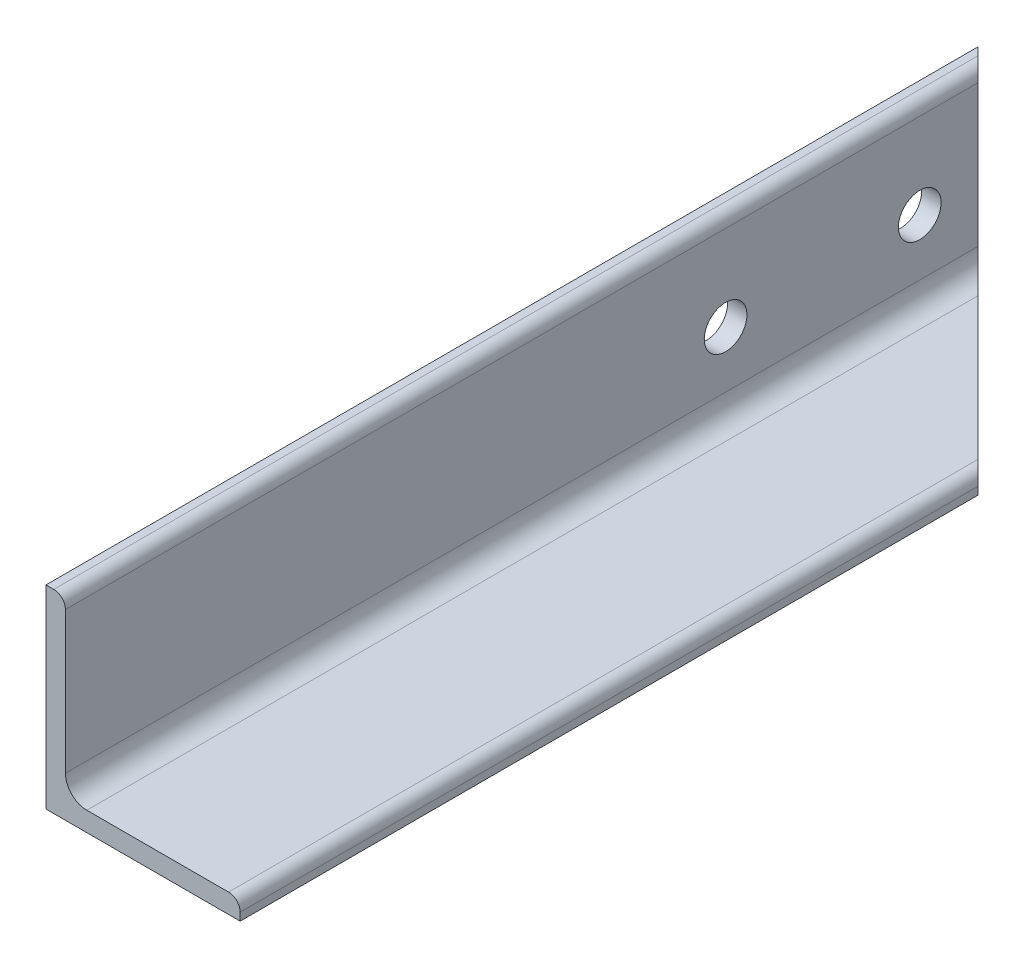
from build123d import *

# Parameters (mm, degrees)
EXTRUDE_1_DEPTH     = 240
SKETCH_2_R          = 5.5
CUT_EXTRUDE_1_DEPTH = 240
CUT_EXTRUDE_2_DEPTH = 240


with BuildPart() as part:
    # Sketch 1 → Extrude 1 (new body)
    with BuildSketch(Plane.XY):
        with BuildLine():
            Line((0, 50), (0, 0))
            Line((0, 0), (50, 0))
            Line((50, 0), (50, 2))
            ThreePointArc((50, 2), (49.121320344, 4.121320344), (47, 5))
            Line((47, 5), (10.5, 5))
            ThreePointArc((10.5, 5), (6.610912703, 6.610912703), (5, 10.5))
            Line((5, 10.5), (5, 47))
            ThreePointArc((5, 47), (4.121320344, 49.121320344), (2, 50))
            Line((2, 50), (0, 50))
        make_face()
    extrude(amount=EXTRUDE_1_DEPTH)

    # Sketch 2 → Cut-Extrude 1 (cut)
    with BuildSketch(Plane.ZY):
        with Locations(Location((20, 25, 0), (0, 0, 270))):
            Circle(SKETCH_2_R)
        with Locations(Location((70, 25, 0), (0, 0, 270))):
            Circle(SKETCH_2_R)
    extrude(amount=-CUT_EXTRUDE_1_DEPTH, mode=Mode.SUBTRACT)

    # Sketch 3 → Cut-Extrude 2 (cut)
    with BuildSketch(Plane.XZ):
        Polygon((0, 0), (50, 0), (50, 50), align=None)
    extrude(amount=-CUT_EXTRUDE_2_DEPTH, mode=Mode.SUBTRACT)


solid = part.part
